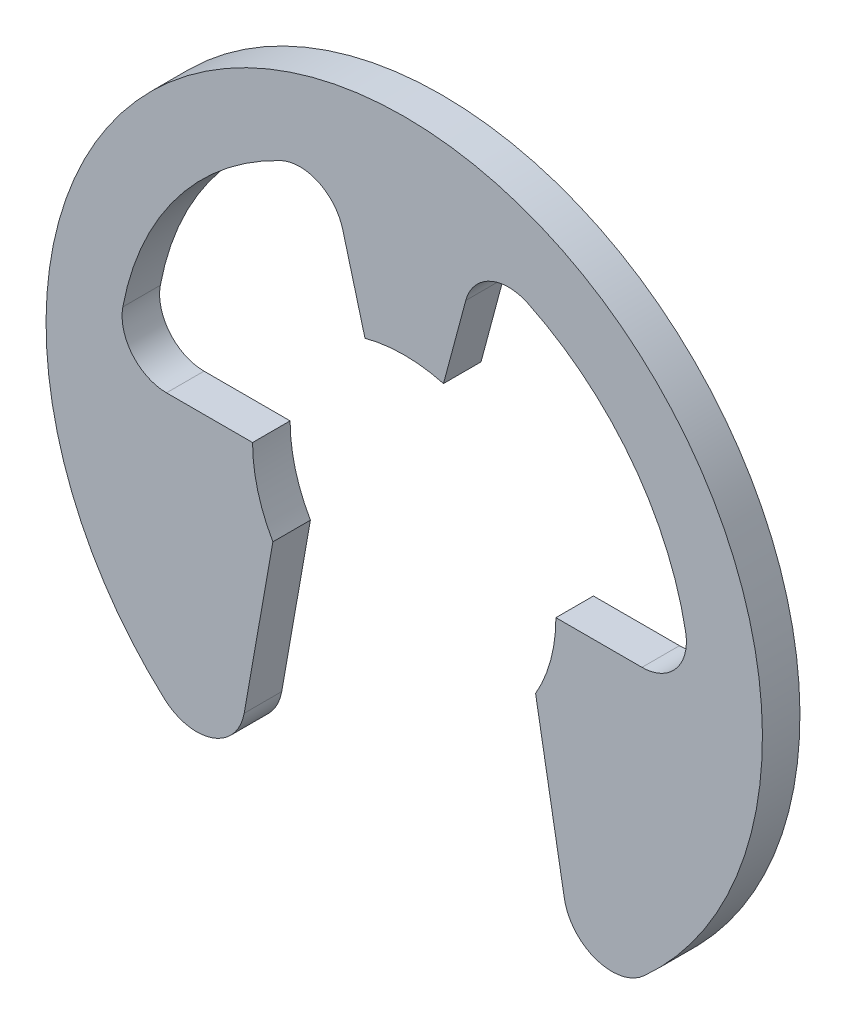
ISO-10303-21;
HEADER;
FILE_DESCRIPTION(('STEP AP214'),'2;1');
FILE_NAME('part.step','',(''),(''),'','','');
FILE_SCHEMA(('AUTOMOTIVE_DESIGN { 1 0 10303 214 1 1 1 1 }'));
ENDSEC;
DATA;
#1=APPLICATION_CONTEXT('core data for automotive mechanical design processes');
#2=APPLICATION_PROTOCOL_DEFINITION('international standard','automotive_design',2000,#1);
#3=PRODUCT_CONTEXT('',#1,'mechanical');
#4=PRODUCT('Part','Part','',(#3));
#5=PRODUCT_RELATED_PRODUCT_CATEGORY('part','',(#4));
#6=PRODUCT_DEFINITION_FORMATION('','',#4);
#7=PRODUCT_DEFINITION_CONTEXT('part definition',#1,'design');
#8=PRODUCT_DEFINITION('design','',#6,#7);
#9=PRODUCT_DEFINITION_SHAPE('','',#8);
#10=(LENGTH_UNIT() NAMED_UNIT(*) SI_UNIT(.MILLI.,.METRE.));
#11=(NAMED_UNIT(*) PLANE_ANGLE_UNIT() SI_UNIT($,.RADIAN.));
#12=(NAMED_UNIT(*) SI_UNIT($,.STERADIAN.) SOLID_ANGLE_UNIT());
#13=UNCERTAINTY_MEASURE_WITH_UNIT(LENGTH_MEASURE(1.E-05),#10,'distance_accuracy_value','');
#14=(GEOMETRIC_REPRESENTATION_CONTEXT(3) GLOBAL_UNCERTAINTY_ASSIGNED_CONTEXT((#13)) GLOBAL_UNIT_ASSIGNED_CONTEXT((#10,
#11,#12)) REPRESENTATION_CONTEXT('',''));
#15=CARTESIAN_POINT('',(0.,0.,0.));
#16=DIRECTION('',(0.,0.,1.));
#17=DIRECTION('',(1.,0.,0.));
#18=AXIS2_PLACEMENT_3D('',#15,#16,#17);
#19=CARTESIAN_POINT('',(3.80114798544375,0.710202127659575,-0.6));
#20=DIRECTION('',(0.,0.,1.));
#21=DIRECTION('',(1.,0.,0.));
#22=AXIS2_PLACEMENT_3D('',#19,#20,#21);
#23=CYLINDRICAL_SURFACE('',#22,0.710202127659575);
#24=CARTESIAN_POINT('',(3.80114798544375,0.710202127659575,0.));
#25=DIRECTION('',(0.,0.,-1.));
#26=DIRECTION('',(1.,0.,0.));
#27=AXIS2_PLACEMENT_3D('',#24,#25,#26);
#28=CIRCLE('',#27,0.710202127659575);
#29=CARTESIAN_POINT('',(4.49926936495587,0.840638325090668,0.));
#30=VERTEX_POINT('',#29);
#31=CARTESIAN_POINT('',(3.80114798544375,0.,0.));
#32=VERTEX_POINT('',#31);
#33=EDGE_CURVE('E150',#30,#32,#28,.T.);
#34=ORIENTED_EDGE('',*,*,#33,.F.);
#35=DIRECTION('',(0.,0.,1.));
#36=VECTOR('',#35,1.);
#37=CARTESIAN_POINT('',(4.49926936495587,0.840638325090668,-0.6));
#38=LINE('',#37,#36);
#39=CARTESIAN_POINT('',(4.49926936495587,0.840638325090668,-0.6));
#40=VERTEX_POINT('',#39);
#41=EDGE_CURVE('E11',#40,#30,#38,.T.);
#42=ORIENTED_EDGE('',*,*,#41,.F.);
#43=CARTESIAN_POINT('',(3.80114798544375,0.710202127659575,-0.6));
#44=DIRECTION('',(0.,0.,-1.));
#45=DIRECTION('',(1.,0.,0.));
#46=AXIS2_PLACEMENT_3D('',#43,#44,#45);
#47=CIRCLE('',#46,0.710202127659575);
#48=CARTESIAN_POINT('',(3.80114798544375,0.,-0.6));
#49=VERTEX_POINT('',#48);
#50=EDGE_CURVE('E152',#40,#49,#47,.T.);
#51=ORIENTED_EDGE('',*,*,#50,.T.);
#52=DIRECTION('',(0.,0.,1.));
#53=VECTOR('',#52,1.);
#54=CARTESIAN_POINT('',(3.80114798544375,0.,-0.6));
#55=LINE('',#54,#53);
#56=EDGE_CURVE('E29',#49,#32,#55,.T.);
#57=ORIENTED_EDGE('',*,*,#56,.T.);
#58=EDGE_LOOP('',(#34,#42,#51,#57));
#59=FACE_BOUND('',#58,.T.);
#60=ADVANCED_FACE('F26',(#59),#23,.F.);
#61=CARTESIAN_POINT('',(0.,0.,-0.6));
#62=DIRECTION('',(0.,0.,1.));
#63=DIRECTION('',(1.,0.,0.));
#64=AXIS2_PLACEMENT_3D('',#61,#62,#63);
#65=CYLINDRICAL_SURFACE('',#64,4.57712765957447);
#66=CARTESIAN_POINT('',(0.,0.,0.));
#67=DIRECTION('',(0.,0.,-1.));
#68=DIRECTION('',(1.,0.,0.));
#69=AXIS2_PLACEMENT_3D('',#66,#67,#68);
#70=CIRCLE('',#69,4.57712765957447);
#71=CARTESIAN_POINT('',(1.97649086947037,4.12838727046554,0.));
#72=VERTEX_POINT('',#71);
#73=EDGE_CURVE('E168',#72,#30,#70,.T.);
#74=ORIENTED_EDGE('',*,*,#73,.F.);
#75=DIRECTION('',(0.,0.,1.));
#76=VECTOR('',#75,1.);
#77=CARTESIAN_POINT('',(1.97649086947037,4.12838727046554,-0.6));
#78=LINE('',#77,#76);
#79=CARTESIAN_POINT('',(1.97649086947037,4.12838727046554,-0.6));
#80=VERTEX_POINT('',#79);
#81=EDGE_CURVE('E34',#80,#72,#78,.T.);
#82=ORIENTED_EDGE('',*,*,#81,.F.);
#83=CARTESIAN_POINT('',(0.,0.,-0.6));
#84=DIRECTION('',(0.,0.,-1.));
#85=DIRECTION('',(1.,0.,0.));
#86=AXIS2_PLACEMENT_3D('',#83,#84,#85);
#87=CIRCLE('',#86,4.57712765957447);
#88=EDGE_CURVE('E157',#80,#40,#87,.T.);
#89=ORIENTED_EDGE('',*,*,#88,.T.);
#90=ORIENTED_EDGE('',*,*,#41,.T.);
#91=EDGE_LOOP('',(#74,#82,#89,#90));
#92=FACE_BOUND('',#91,.T.);
#93=ADVANCED_FACE('F347',(#92),#65,.F.);
#94=CARTESIAN_POINT('',(1.66981206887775,3.48781317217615,-0.6));
#95=DIRECTION('',(0.,0.,1.));
#96=DIRECTION('',(1.,0.,0.));
#97=AXIS2_PLACEMENT_3D('',#94,#95,#96);
#98=CYLINDRICAL_SURFACE('',#97,0.710202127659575);
#99=CARTESIAN_POINT('',(1.66981206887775,3.48781317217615,0.));
#100=DIRECTION('',(0.,0.,-1.));
#101=DIRECTION('',(1.,0.,0.));
#102=AXIS2_PLACEMENT_3D('',#99,#100,#101);
#103=CIRCLE('',#102,0.710202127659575);
#104=CARTESIAN_POINT('',(0.983809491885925,3.67162700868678,0.));
#105=VERTEX_POINT('',#104);
#106=EDGE_CURVE('E211',#105,#72,#103,.T.);
#107=ORIENTED_EDGE('',*,*,#106,.F.);
#108=DIRECTION('',(0.,0.,1.));
#109=VECTOR('',#108,1.);
#110=CARTESIAN_POINT('',(0.983809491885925,3.67162700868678,-0.6));
#111=LINE('',#110,#109);
#112=CARTESIAN_POINT('',(0.983809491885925,3.67162700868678,-0.6));
#113=VERTEX_POINT('',#112);
#114=EDGE_CURVE('E263',#113,#105,#111,.T.);
#115=ORIENTED_EDGE('',*,*,#114,.F.);
#116=CARTESIAN_POINT('',(1.66981206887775,3.48781317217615,-0.6));
#117=DIRECTION('',(0.,0.,-1.));
#118=DIRECTION('',(1.,0.,0.));
#119=AXIS2_PLACEMENT_3D('',#116,#117,#118);
#120=CIRCLE('',#119,0.710202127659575);
#121=EDGE_CURVE('E259',#113,#80,#120,.T.);
#122=ORIENTED_EDGE('',*,*,#121,.T.);
#123=ORIENTED_EDGE('',*,*,#81,.T.);
#124=EDGE_LOOP('',(#107,#115,#122,#123));
#125=FACE_BOUND('',#124,.T.);
#126=ADVANCED_FACE('F352',(#125),#98,.F.);
#127=CARTESIAN_POINT('',(0.627636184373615,2.34237012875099,-0.6));
#128=DIRECTION('',(0.965925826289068,-0.258819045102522,0.));
#129=DIRECTION('',(0.258819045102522,0.965925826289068,0.));
#130=AXIS2_PLACEMENT_3D('',#127,#128,#129);
#131=PLANE('',#130);
#132=DIRECTION('',(0.258819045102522,0.965925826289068,0.));
#133=VECTOR('',#132,1.);
#134=CARTESIAN_POINT('',(0.627636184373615,2.34237012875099,0.));
#135=LINE('',#134,#133);
#136=CARTESIAN_POINT('',(0.627636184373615,2.34237012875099,0.));
#137=VERTEX_POINT('',#136);
#138=EDGE_CURVE('E208',#137,#105,#135,.T.);
#139=ORIENTED_EDGE('',*,*,#138,.F.);
#140=DIRECTION('',(0.,0.,1.));
#141=VECTOR('',#140,1.);
#142=CARTESIAN_POINT('',(0.627636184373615,2.34237012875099,-0.6));
#143=LINE('',#142,#141);
#144=CARTESIAN_POINT('',(0.627636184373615,2.34237012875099,-0.6));
#145=VERTEX_POINT('',#144);
#146=EDGE_CURVE('E265',#145,#137,#143,.T.);
#147=ORIENTED_EDGE('',*,*,#146,.F.);
#148=DIRECTION('',(0.258819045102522,0.965925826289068,0.));
#149=VECTOR('',#148,1.);
#150=CARTESIAN_POINT('',(0.627636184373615,2.34237012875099,-0.6));
#151=LINE('',#150,#149);
#152=EDGE_CURVE('E256',#145,#113,#151,.T.);
#153=ORIENTED_EDGE('',*,*,#152,.T.);
#154=ORIENTED_EDGE('',*,*,#114,.T.);
#155=EDGE_LOOP('',(#139,#147,#153,#154));
#156=FACE_BOUND('',#155,.T.);
#157=ADVANCED_FACE('F344',(#156),#131,.T.);
#158=CARTESIAN_POINT('',(0.,0.,-0.6));
#159=DIRECTION('',(0.,0.,1.));
#160=DIRECTION('',(1.,0.,0.));
#161=AXIS2_PLACEMENT_3D('',#158,#159,#160);
#162=CYLINDRICAL_SURFACE('',#161,2.425);
#163=CARTESIAN_POINT('',(0.,0.,0.));
#164=DIRECTION('',(0.,0.,-1.));
#165=DIRECTION('',(-1.,0.,0.));
#166=AXIS2_PLACEMENT_3D('',#163,#164,#165);
#167=CIRCLE('',#166,2.425);
#168=CARTESIAN_POINT('',(-0.627636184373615,2.34237012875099,0.));
#169=VERTEX_POINT('',#168);
#170=EDGE_CURVE('E205',#169,#137,#167,.T.);
#171=ORIENTED_EDGE('',*,*,#170,.F.);
#172=DIRECTION('',(0.,0.,1.));
#173=VECTOR('',#172,1.);
#174=CARTESIAN_POINT('',(-0.627636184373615,2.34237012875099,-0.6));
#175=LINE('',#174,#173);
#176=CARTESIAN_POINT('',(-0.627636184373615,2.34237012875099,-0.6));
#177=VERTEX_POINT('',#176);
#178=EDGE_CURVE('E267',#177,#169,#175,.T.);
#179=ORIENTED_EDGE('',*,*,#178,.F.);
#180=CARTESIAN_POINT('',(0.,0.,-0.6));
#181=DIRECTION('',(0.,0.,-1.));
#182=DIRECTION('',(-1.,0.,0.));
#183=AXIS2_PLACEMENT_3D('',#180,#181,#182);
#184=CIRCLE('',#183,2.425);
#185=EDGE_CURVE('E253',#177,#145,#184,.T.);
#186=ORIENTED_EDGE('',*,*,#185,.T.);
#187=ORIENTED_EDGE('',*,*,#146,.T.);
#188=EDGE_LOOP('',(#171,#179,#186,#187));
#189=FACE_BOUND('',#188,.T.);
#190=ADVANCED_FACE('F340',(#189),#162,.F.);
#191=CARTESIAN_POINT('',(-0.627636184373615,2.34237012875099,-0.6));
#192=DIRECTION('',(-0.965925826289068,-0.258819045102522,0.));
#193=DIRECTION('',(0.258819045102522,-0.965925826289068,0.));
#194=AXIS2_PLACEMENT_3D('',#191,#192,#193);
#195=PLANE('',#194);
#196=DIRECTION('',(0.258819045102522,-0.965925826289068,0.));
#197=VECTOR('',#196,1.);
#198=CARTESIAN_POINT('',(-0.627636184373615,2.34237012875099,0.));
#199=LINE('',#198,#197);
#200=CARTESIAN_POINT('',(-0.983809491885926,3.67162700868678,0.));
#201=VERTEX_POINT('',#200);
#202=EDGE_CURVE('E202',#201,#169,#199,.T.);
#203=ORIENTED_EDGE('',*,*,#202,.F.);
#204=DIRECTION('',(0.,0.,1.));
#205=VECTOR('',#204,1.);
#206=CARTESIAN_POINT('',(-0.983809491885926,3.67162700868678,-0.6));
#207=LINE('',#206,#205);
#208=CARTESIAN_POINT('',(-0.983809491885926,3.67162700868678,-0.6));
#209=VERTEX_POINT('',#208);
#210=EDGE_CURVE('E269',#209,#201,#207,.T.);
#211=ORIENTED_EDGE('',*,*,#210,.F.);
#212=DIRECTION('',(0.258819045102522,-0.965925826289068,0.));
#213=VECTOR('',#212,1.);
#214=CARTESIAN_POINT('',(-0.627636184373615,2.34237012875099,-0.6));
#215=LINE('',#214,#213);
#216=EDGE_CURVE('E250',#209,#177,#215,.T.);
#217=ORIENTED_EDGE('',*,*,#216,.T.);
#218=ORIENTED_EDGE('',*,*,#178,.T.);
#219=EDGE_LOOP('',(#203,#211,#217,#218));
#220=FACE_BOUND('',#219,.T.);
#221=ADVANCED_FACE('F336',(#220),#195,.T.);
#222=CARTESIAN_POINT('',(-1.66981206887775,3.48781317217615,-0.6));
#223=DIRECTION('',(0.,0.,1.));
#224=DIRECTION('',(1.,0.,0.));
#225=AXIS2_PLACEMENT_3D('',#222,#223,#224);
#226=CYLINDRICAL_SURFACE('',#225,0.710202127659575);
#227=CARTESIAN_POINT('',(-1.66981206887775,3.48781317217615,0.));
#228=DIRECTION('',(0.,0.,-1.));
#229=DIRECTION('',(1.,0.,0.));
#230=AXIS2_PLACEMENT_3D('',#227,#228,#229);
#231=CIRCLE('',#230,0.710202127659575);
#232=CARTESIAN_POINT('',(-1.97649086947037,4.12838727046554,0.));
#233=VERTEX_POINT('',#232);
#234=EDGE_CURVE('E199',#233,#201,#231,.T.);
#235=ORIENTED_EDGE('',*,*,#234,.F.);
#236=DIRECTION('',(0.,0.,1.));
#237=VECTOR('',#236,1.);
#238=CARTESIAN_POINT('',(-1.97649086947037,4.12838727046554,-0.6));
#239=LINE('',#238,#237);
#240=CARTESIAN_POINT('',(-1.97649086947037,4.12838727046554,-0.6));
#241=VERTEX_POINT('',#240);
#242=EDGE_CURVE('E271',#241,#233,#239,.T.);
#243=ORIENTED_EDGE('',*,*,#242,.F.);
#244=CARTESIAN_POINT('',(-1.66981206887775,3.48781317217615,-0.6));
#245=DIRECTION('',(0.,0.,-1.));
#246=DIRECTION('',(1.,0.,0.));
#247=AXIS2_PLACEMENT_3D('',#244,#245,#246);
#248=CIRCLE('',#247,0.710202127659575);
#249=EDGE_CURVE('E247',#241,#209,#248,.T.);
#250=ORIENTED_EDGE('',*,*,#249,.T.);
#251=ORIENTED_EDGE('',*,*,#210,.T.);
#252=EDGE_LOOP('',(#235,#243,#250,#251));
#253=FACE_BOUND('',#252,.T.);
#254=ADVANCED_FACE('F332',(#253),#226,.F.);
#255=CARTESIAN_POINT('',(0.,0.,-0.6));
#256=DIRECTION('',(0.,0.,1.));
#257=DIRECTION('',(1.,0.,0.));
#258=AXIS2_PLACEMENT_3D('',#255,#256,#257);
#259=CYLINDRICAL_SURFACE('',#258,4.57712765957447);
#260=CARTESIAN_POINT('',(0.,0.,0.));
#261=DIRECTION('',(0.,0.,-1.));
#262=DIRECTION('',(1.,0.,0.));
#263=AXIS2_PLACEMENT_3D('',#260,#261,#262);
#264=CIRCLE('',#263,4.57712765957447);
#265=CARTESIAN_POINT('',(-4.49926936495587,0.840638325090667,0.));
#266=VERTEX_POINT('',#265);
#267=EDGE_CURVE('E196',#266,#233,#264,.T.);
#268=ORIENTED_EDGE('',*,*,#267,.F.);
#269=DIRECTION('',(0.,0.,1.));
#270=VECTOR('',#269,1.);
#271=CARTESIAN_POINT('',(-4.49926936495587,0.840638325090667,-0.6));
#272=LINE('',#271,#270);
#273=CARTESIAN_POINT('',(-4.49926936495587,0.840638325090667,-0.6));
#274=VERTEX_POINT('',#273);
#275=EDGE_CURVE('E273',#274,#266,#272,.T.);
#276=ORIENTED_EDGE('',*,*,#275,.F.);
#277=CARTESIAN_POINT('',(0.,0.,-0.6));
#278=DIRECTION('',(0.,0.,-1.));
#279=DIRECTION('',(1.,0.,0.));
#280=AXIS2_PLACEMENT_3D('',#277,#278,#279);
#281=CIRCLE('',#280,4.57712765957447);
#282=EDGE_CURVE('E244',#274,#241,#281,.T.);
#283=ORIENTED_EDGE('',*,*,#282,.T.);
#284=ORIENTED_EDGE('',*,*,#242,.T.);
#285=EDGE_LOOP('',(#268,#276,#283,#284));
#286=FACE_BOUND('',#285,.T.);
#287=ADVANCED_FACE('F328',(#286),#259,.F.);
#288=CARTESIAN_POINT('',(-3.80114798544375,0.710202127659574,-0.6));
#289=DIRECTION('',(0.,0.,1.));
#290=DIRECTION('',(1.,0.,0.));
#291=AXIS2_PLACEMENT_3D('',#288,#289,#290);
#292=CYLINDRICAL_SURFACE('',#291,0.710202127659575);
#293=CARTESIAN_POINT('',(-3.80114798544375,0.710202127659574,0.));
#294=DIRECTION('',(0.,0.,-1.));
#295=DIRECTION('',(1.,0.,0.));
#296=AXIS2_PLACEMENT_3D('',#293,#294,#295);
#297=CIRCLE('',#296,0.710202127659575);
#298=CARTESIAN_POINT('',(-3.80114798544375,0.,0.));
#299=VERTEX_POINT('',#298);
#300=EDGE_CURVE('E193',#299,#266,#297,.T.);
#301=ORIENTED_EDGE('',*,*,#300,.F.);
#302=DIRECTION('',(0.,0.,1.));
#303=VECTOR('',#302,1.);
#304=CARTESIAN_POINT('',(-3.80114798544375,0.,-0.6));
#305=LINE('',#304,#303);
#306=CARTESIAN_POINT('',(-3.80114798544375,0.,-0.6));
#307=VERTEX_POINT('',#306);
#308=EDGE_CURVE('E275',#307,#299,#305,.T.);
#309=ORIENTED_EDGE('',*,*,#308,.F.);
#310=CARTESIAN_POINT('',(-3.80114798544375,0.710202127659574,-0.6));
#311=DIRECTION('',(0.,0.,-1.));
#312=DIRECTION('',(1.,0.,0.));
#313=AXIS2_PLACEMENT_3D('',#310,#311,#312);
#314=CIRCLE('',#313,0.710202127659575);
#315=EDGE_CURVE('E241',#307,#274,#314,.T.);
#316=ORIENTED_EDGE('',*,*,#315,.T.);
#317=ORIENTED_EDGE('',*,*,#275,.T.);
#318=EDGE_LOOP('',(#301,#309,#316,#317));
#319=FACE_BOUND('',#318,.T.);
#320=ADVANCED_FACE('F324',(#319),#292,.F.);
#321=CARTESIAN_POINT('',(-2.425,0.,-0.6));
#322=DIRECTION('',(0.,1.,0.));
#323=DIRECTION('',(-1.,0.,0.));
#324=AXIS2_PLACEMENT_3D('',#321,#322,#323);
#325=PLANE('',#324);
#326=DIRECTION('',(-1.,0.,0.));
#327=VECTOR('',#326,1.);
#328=CARTESIAN_POINT('',(-2.425,0.,0.));
#329=LINE('',#328,#327);
#330=CARTESIAN_POINT('',(-2.425,0.,0.));
#331=VERTEX_POINT('',#330);
#332=EDGE_CURVE('E190',#331,#299,#329,.T.);
#333=ORIENTED_EDGE('',*,*,#332,.F.);
#334=DIRECTION('',(0.,0.,1.));
#335=VECTOR('',#334,1.);
#336=CARTESIAN_POINT('',(-2.425,0.,-0.6));
#337=LINE('',#336,#335);
#338=CARTESIAN_POINT('',(-2.425,0.,-0.6));
#339=VERTEX_POINT('',#338);
#340=EDGE_CURVE('E277',#339,#331,#337,.T.);
#341=ORIENTED_EDGE('',*,*,#340,.F.);
#342=DIRECTION('',(-1.,0.,0.));
#343=VECTOR('',#342,1.);
#344=CARTESIAN_POINT('',(-2.425,0.,-0.6));
#345=LINE('',#344,#343);
#346=EDGE_CURVE('E238',#339,#307,#345,.T.);
#347=ORIENTED_EDGE('',*,*,#346,.T.);
#348=ORIENTED_EDGE('',*,*,#308,.T.);
#349=EDGE_LOOP('',(#333,#341,#347,#348));
#350=FACE_BOUND('',#349,.T.);
#351=ADVANCED_FACE('F320',(#350),#325,.T.);
#352=CARTESIAN_POINT('',(0.,0.,-0.6));
#353=DIRECTION('',(0.,0.,1.));
#354=DIRECTION('',(1.,0.,0.));
#355=AXIS2_PLACEMENT_3D('',#352,#353,#354);
#356=CYLINDRICAL_SURFACE('',#355,2.425);
#357=CARTESIAN_POINT('',(0.,0.,0.));
#358=DIRECTION('',(0.,0.,-1.));
#359=DIRECTION('',(1.,0.,0.));
#360=AXIS2_PLACEMENT_3D('',#357,#358,#359);
#361=CIRCLE('',#360,2.425);
#362=CARTESIAN_POINT('',(-2.10011160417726,-1.2125,0.));
#363=VERTEX_POINT('',#362);
#364=EDGE_CURVE('E187',#363,#331,#361,.T.);
#365=ORIENTED_EDGE('',*,*,#364,.F.);
#366=DIRECTION('',(0.,0.,1.));
#367=VECTOR('',#366,1.);
#368=CARTESIAN_POINT('',(-2.10011160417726,-1.2125,-0.6));
#369=LINE('',#368,#367);
#370=CARTESIAN_POINT('',(-2.10011160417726,-1.2125,-0.6));
#371=VERTEX_POINT('',#370);
#372=EDGE_CURVE('E279',#371,#363,#369,.T.);
#373=ORIENTED_EDGE('',*,*,#372,.F.);
#374=CARTESIAN_POINT('',(0.,0.,-0.6));
#375=DIRECTION('',(0.,0.,-1.));
#376=DIRECTION('',(1.,0.,0.));
#377=AXIS2_PLACEMENT_3D('',#374,#375,#376);
#378=CIRCLE('',#377,2.425);
#379=EDGE_CURVE('E235',#371,#339,#378,.T.);
#380=ORIENTED_EDGE('',*,*,#379,.T.);
#381=ORIENTED_EDGE('',*,*,#340,.T.);
#382=EDGE_LOOP('',(#365,#373,#380,#381));
#383=FACE_BOUND('',#382,.T.);
#384=ADVANCED_FACE('F316',(#383),#356,.F.);
#385=CARTESIAN_POINT('',(-2.10011160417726,-1.2125,-0.6));
#386=DIRECTION('',(0.984807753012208,-0.17364817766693,0.));
#387=DIRECTION('',(0.17364817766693,0.984807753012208,0.));
#388=AXIS2_PLACEMENT_3D('',#385,#386,#387);
#389=PLANE('',#388);
#390=DIRECTION('',(0.17364817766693,0.984807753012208,0.));
#391=VECTOR('',#390,1.);
#392=CARTESIAN_POINT('',(-2.10011160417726,-1.2125,0.));
#393=LINE('',#392,#391);
#394=CARTESIAN_POINT('',(-2.55919096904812,-3.81606845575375,0.));
#395=VERTEX_POINT('',#394);
#396=EDGE_CURVE('E184',#395,#363,#393,.T.);
#397=ORIENTED_EDGE('',*,*,#396,.F.);
#398=DIRECTION('',(0.,0.,1.));
#399=VECTOR('',#398,1.);
#400=CARTESIAN_POINT('',(-2.55919096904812,-3.81606845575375,-0.6));
#401=LINE('',#400,#399);
#402=CARTESIAN_POINT('',(-2.55919096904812,-3.81606845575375,-0.6));
#403=VERTEX_POINT('',#402);
#404=EDGE_CURVE('E281',#403,#395,#401,.T.);
#405=ORIENTED_EDGE('',*,*,#404,.F.);
#406=DIRECTION('',(0.17364817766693,0.984807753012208,0.));
#407=VECTOR('',#406,1.);
#408=CARTESIAN_POINT('',(-2.10011160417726,-1.2125,-0.6));
#409=LINE('',#408,#407);
#410=EDGE_CURVE('E232',#403,#371,#409,.T.);
#411=ORIENTED_EDGE('',*,*,#410,.T.);
#412=ORIENTED_EDGE('',*,*,#372,.T.);
#413=EDGE_LOOP('',(#397,#405,#411,#412));
#414=FACE_BOUND('',#413,.T.);
#415=ADVANCED_FACE('F312',(#414),#389,.T.);
#416=CARTESIAN_POINT('',(-3.31798534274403,-3.68227253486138,-0.6));
#417=DIRECTION('',(0.,0.,1.));
#418=DIRECTION('',(1.,0.,0.));
#419=AXIS2_PLACEMENT_3D('',#416,#417,#418);
#420=CYLINDRICAL_SURFACE('',#419,0.7705);
#421=CARTESIAN_POINT('',(-3.31798534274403,-3.68227253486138,0.));
#422=DIRECTION('',(0.,0.,1.));
#423=DIRECTION('',(1.,0.,0.));
#424=AXIS2_PLACEMENT_3D('',#421,#422,#423);
#425=CIRCLE('',#424,0.7705);
#426=CARTESIAN_POINT('',(-3.83376096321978,-4.25467602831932,0.));
#427=VERTEX_POINT('',#426);
#428=EDGE_CURVE('E181',#427,#395,#425,.T.);
#429=ORIENTED_EDGE('',*,*,#428,.F.);
#430=DIRECTION('',(0.,0.,1.));
#431=VECTOR('',#430,1.);
#432=CARTESIAN_POINT('',(-3.83376096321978,-4.25467602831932,-0.6));
#433=LINE('',#432,#431);
#434=CARTESIAN_POINT('',(-3.83376096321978,-4.25467602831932,-0.6));
#435=VERTEX_POINT('',#434);
#436=EDGE_CURVE('E283',#435,#427,#433,.T.);
#437=ORIENTED_EDGE('',*,*,#436,.F.);
#438=CARTESIAN_POINT('',(-3.31798534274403,-3.68227253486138,-0.6));
#439=DIRECTION('',(0.,0.,1.));
#440=DIRECTION('',(1.,0.,0.));
#441=AXIS2_PLACEMENT_3D('',#438,#439,#440);
#442=CIRCLE('',#441,0.7705);
#443=EDGE_CURVE('E229',#435,#403,#442,.T.);
#444=ORIENTED_EDGE('',*,*,#443,.T.);
#445=ORIENTED_EDGE('',*,*,#404,.T.);
#446=EDGE_LOOP('',(#429,#437,#444,#445));
#447=FACE_BOUND('',#446,.T.);
#448=ADVANCED_FACE('F308',(#447),#420,.T.);
#449=CARTESIAN_POINT('',(0.,0.,-0.6));
#450=DIRECTION('',(0.,0.,1.));
#451=DIRECTION('',(1.,0.,0.));
#452=AXIS2_PLACEMENT_3D('',#449,#450,#451);
#453=CYLINDRICAL_SURFACE('',#452,5.72712765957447);
#454=CARTESIAN_POINT('',(0.,0.,0.));
#455=DIRECTION('',(0.,0.,1.));
#456=DIRECTION('',(1.,0.,0.));
#457=AXIS2_PLACEMENT_3D('',#454,#455,#456);
#458=CIRCLE('',#457,5.72712765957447);
#459=CARTESIAN_POINT('',(3.83376096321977,-4.25467602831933,0.));
#460=VERTEX_POINT('',#459);
#461=EDGE_CURVE('E178',#460,#427,#458,.T.);
#462=ORIENTED_EDGE('',*,*,#461,.F.);
#463=DIRECTION('',(0.,0.,1.));
#464=VECTOR('',#463,1.);
#465=CARTESIAN_POINT('',(3.83376096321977,-4.25467602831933,-0.6));
#466=LINE('',#465,#464);
#467=CARTESIAN_POINT('',(3.83376096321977,-4.25467602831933,-0.6));
#468=VERTEX_POINT('',#467);
#469=EDGE_CURVE('E285',#468,#460,#466,.T.);
#470=ORIENTED_EDGE('',*,*,#469,.F.);
#471=CARTESIAN_POINT('',(0.,0.,-0.6));
#472=DIRECTION('',(0.,0.,1.));
#473=DIRECTION('',(1.,0.,0.));
#474=AXIS2_PLACEMENT_3D('',#471,#472,#473);
#475=CIRCLE('',#474,5.72712765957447);
#476=EDGE_CURVE('E226',#468,#435,#475,.T.);
#477=ORIENTED_EDGE('',*,*,#476,.T.);
#478=ORIENTED_EDGE('',*,*,#436,.T.);
#479=EDGE_LOOP('',(#462,#470,#477,#478));
#480=FACE_BOUND('',#479,.T.);
#481=ADVANCED_FACE('F304',(#480),#453,.T.);
#482=CARTESIAN_POINT('',(3.31798534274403,-3.68227253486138,-0.6));
#483=DIRECTION('',(0.,0.,1.));
#484=DIRECTION('',(1.,0.,0.));
#485=AXIS2_PLACEMENT_3D('',#482,#483,#484);
#486=CYLINDRICAL_SURFACE('',#485,0.7705);
#487=CARTESIAN_POINT('',(3.31798534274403,-3.68227253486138,0.));
#488=DIRECTION('',(0.,0.,1.));
#489=DIRECTION('',(1.,0.,0.));
#490=AXIS2_PLACEMENT_3D('',#487,#488,#489);
#491=CIRCLE('',#490,0.7705);
#492=CARTESIAN_POINT('',(2.55919096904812,-3.81606845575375,0.));
#493=VERTEX_POINT('',#492);
#494=EDGE_CURVE('E175',#493,#460,#491,.T.);
#495=ORIENTED_EDGE('',*,*,#494,.F.);
#496=DIRECTION('',(0.,0.,1.));
#497=VECTOR('',#496,1.);
#498=CARTESIAN_POINT('',(2.55919096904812,-3.81606845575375,-0.6));
#499=LINE('',#498,#497);
#500=CARTESIAN_POINT('',(2.55919096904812,-3.81606845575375,-0.6));
#501=VERTEX_POINT('',#500);
#502=EDGE_CURVE('E287',#501,#493,#499,.T.);
#503=ORIENTED_EDGE('',*,*,#502,.F.);
#504=CARTESIAN_POINT('',(3.31798534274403,-3.68227253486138,-0.6));
#505=DIRECTION('',(0.,0.,1.));
#506=DIRECTION('',(1.,0.,0.));
#507=AXIS2_PLACEMENT_3D('',#504,#505,#506);
#508=CIRCLE('',#507,0.7705);
#509=EDGE_CURVE('E223',#501,#468,#508,.T.);
#510=ORIENTED_EDGE('',*,*,#509,.T.);
#511=ORIENTED_EDGE('',*,*,#469,.T.);
#512=EDGE_LOOP('',(#495,#503,#510,#511));
#513=FACE_BOUND('',#512,.T.);
#514=ADVANCED_FACE('F300',(#513),#486,.T.);
#515=CARTESIAN_POINT('',(2.10011160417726,-1.2125,-0.6));
#516=DIRECTION('',(-0.984807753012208,-0.17364817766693,0.));
#517=DIRECTION('',(0.17364817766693,-0.984807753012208,0.));
#518=AXIS2_PLACEMENT_3D('',#515,#516,#517);
#519=PLANE('',#518);
#520=DIRECTION('',(0.17364817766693,-0.984807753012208,0.));
#521=VECTOR('',#520,1.);
#522=CARTESIAN_POINT('',(2.10011160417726,-1.2125,0.));
#523=LINE('',#522,#521);
#524=CARTESIAN_POINT('',(2.10011160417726,-1.2125,0.));
#525=VERTEX_POINT('',#524);
#526=EDGE_CURVE('E172',#525,#493,#523,.T.);
#527=ORIENTED_EDGE('',*,*,#526,.F.);
#528=DIRECTION('',(0.,0.,1.));
#529=VECTOR('',#528,1.);
#530=CARTESIAN_POINT('',(2.10011160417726,-1.2125,-0.6));
#531=LINE('',#530,#529);
#532=CARTESIAN_POINT('',(2.10011160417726,-1.2125,-0.6));
#533=VERTEX_POINT('',#532);
#534=EDGE_CURVE('E289',#533,#525,#531,.T.);
#535=ORIENTED_EDGE('',*,*,#534,.F.);
#536=DIRECTION('',(0.17364817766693,-0.984807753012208,0.));
#537=VECTOR('',#536,1.);
#538=CARTESIAN_POINT('',(2.10011160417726,-1.2125,-0.6));
#539=LINE('',#538,#537);
#540=EDGE_CURVE('E220',#533,#501,#539,.T.);
#541=ORIENTED_EDGE('',*,*,#540,.T.);
#542=ORIENTED_EDGE('',*,*,#502,.T.);
#543=EDGE_LOOP('',(#527,#535,#541,#542));
#544=FACE_BOUND('',#543,.T.);
#545=ADVANCED_FACE('F296',(#544),#519,.T.);
#546=CARTESIAN_POINT('',(0.,0.,-0.6));
#547=DIRECTION('',(0.,0.,1.));
#548=DIRECTION('',(1.,0.,0.));
#549=AXIS2_PLACEMENT_3D('',#546,#547,#548);
#550=CYLINDRICAL_SURFACE('',#549,2.425);
#551=CARTESIAN_POINT('',(0.,0.,0.));
#552=DIRECTION('',(0.,0.,-1.));
#553=DIRECTION('',(1.,0.,0.));
#554=AXIS2_PLACEMENT_3D('',#551,#552,#553);
#555=CIRCLE('',#554,2.425);
#556=CARTESIAN_POINT('',(2.425,0.,0.));
#557=VERTEX_POINT('',#556);
#558=EDGE_CURVE('E164',#557,#525,#555,.T.);
#559=ORIENTED_EDGE('',*,*,#558,.F.);
#560=DIRECTION('',(0.,0.,1.));
#561=VECTOR('',#560,1.);
#562=CARTESIAN_POINT('',(2.425,0.,-0.6));
#563=LINE('',#562,#561);
#564=CARTESIAN_POINT('',(2.425,0.,-0.6));
#565=VERTEX_POINT('',#564);
#566=EDGE_CURVE('E156',#565,#557,#563,.T.);
#567=ORIENTED_EDGE('',*,*,#566,.F.);
#568=CARTESIAN_POINT('',(0.,0.,-0.6));
#569=DIRECTION('',(0.,0.,-1.));
#570=DIRECTION('',(1.,0.,0.));
#571=AXIS2_PLACEMENT_3D('',#568,#569,#570);
#572=CIRCLE('',#571,2.425);
#573=EDGE_CURVE('E217',#565,#533,#572,.T.);
#574=ORIENTED_EDGE('',*,*,#573,.T.);
#575=ORIENTED_EDGE('',*,*,#534,.T.);
#576=EDGE_LOOP('',(#559,#567,#574,#575));
#577=FACE_BOUND('',#576,.T.);
#578=ADVANCED_FACE('F292',(#577),#550,.F.);
#579=CARTESIAN_POINT('',(2.425,0.,-0.6));
#580=DIRECTION('',(0.,1.,0.));
#581=DIRECTION('',(0.,0.,1.));
#582=AXIS2_PLACEMENT_3D('',#579,#580,#581);
#583=PLANE('',#582);
#584=DIRECTION('',(-1.,0.,0.));
#585=VECTOR('',#584,1.);
#586=CARTESIAN_POINT('',(2.425,0.,0.));
#587=LINE('',#586,#585);
#588=EDGE_CURVE('E159',#32,#557,#587,.T.);
#589=ORIENTED_EDGE('',*,*,#588,.F.);
#590=ORIENTED_EDGE('',*,*,#56,.F.);
#591=DIRECTION('',(-1.,0.,0.));
#592=VECTOR('',#591,1.);
#593=CARTESIAN_POINT('',(2.425,0.,-0.6));
#594=LINE('',#593,#592);
#595=EDGE_CURVE('E215',#49,#565,#594,.T.);
#596=ORIENTED_EDGE('',*,*,#595,.T.);
#597=ORIENTED_EDGE('',*,*,#566,.T.);
#598=EDGE_LOOP('',(#589,#590,#596,#597));
#599=FACE_BOUND('',#598,.T.);
#600=ADVANCED_FACE('F160',(#599),#583,.T.);
#601=CARTESIAN_POINT('',(3.80114798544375,0.710202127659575,-0.6));
#602=DIRECTION('',(0.,0.,1.));
#603=DIRECTION('',(1.,0.,0.));
#604=AXIS2_PLACEMENT_3D('',#601,#602,#603);
#605=PLANE('',#604);
#606=ORIENTED_EDGE('',*,*,#50,.F.);
#607=ORIENTED_EDGE('',*,*,#88,.F.);
#608=ORIENTED_EDGE('',*,*,#121,.F.);
#609=ORIENTED_EDGE('',*,*,#152,.F.);
#610=ORIENTED_EDGE('',*,*,#185,.F.);
#611=ORIENTED_EDGE('',*,*,#216,.F.);
#612=ORIENTED_EDGE('',*,*,#249,.F.);
#613=ORIENTED_EDGE('',*,*,#282,.F.);
#614=ORIENTED_EDGE('',*,*,#315,.F.);
#615=ORIENTED_EDGE('',*,*,#346,.F.);
#616=ORIENTED_EDGE('',*,*,#379,.F.);
#617=ORIENTED_EDGE('',*,*,#410,.F.);
#618=ORIENTED_EDGE('',*,*,#443,.F.);
#619=ORIENTED_EDGE('',*,*,#476,.F.);
#620=ORIENTED_EDGE('',*,*,#509,.F.);
#621=ORIENTED_EDGE('',*,*,#540,.F.);
#622=ORIENTED_EDGE('',*,*,#573,.F.);
#623=ORIENTED_EDGE('',*,*,#595,.F.);
#624=EDGE_LOOP('',(#606,#607,#608,#609,#610,#611,#612,#613,#614,#615,#616,#617,#618,#619,#620,
#621,#622,#623));
#625=FACE_BOUND('',#624,.T.);
#626=ADVANCED_FACE('F351',(#625),#605,.F.);
#627=CARTESIAN_POINT('',(3.80114798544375,0.710202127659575,0.));
#628=DIRECTION('',(0.,0.,1.));
#629=DIRECTION('',(1.,0.,0.));
#630=AXIS2_PLACEMENT_3D('',#627,#628,#629);
#631=PLANE('',#630);
#632=ORIENTED_EDGE('',*,*,#33,.T.);
#633=ORIENTED_EDGE('',*,*,#588,.T.);
#634=ORIENTED_EDGE('',*,*,#558,.T.);
#635=ORIENTED_EDGE('',*,*,#526,.T.);
#636=ORIENTED_EDGE('',*,*,#494,.T.);
#637=ORIENTED_EDGE('',*,*,#461,.T.);
#638=ORIENTED_EDGE('',*,*,#428,.T.);
#639=ORIENTED_EDGE('',*,*,#396,.T.);
#640=ORIENTED_EDGE('',*,*,#364,.T.);
#641=ORIENTED_EDGE('',*,*,#332,.T.);
#642=ORIENTED_EDGE('',*,*,#300,.T.);
#643=ORIENTED_EDGE('',*,*,#267,.T.);
#644=ORIENTED_EDGE('',*,*,#234,.T.);
#645=ORIENTED_EDGE('',*,*,#202,.T.);
#646=ORIENTED_EDGE('',*,*,#170,.T.);
#647=ORIENTED_EDGE('',*,*,#138,.T.);
#648=ORIENTED_EDGE('',*,*,#106,.T.);
#649=ORIENTED_EDGE('',*,*,#73,.T.);
#650=EDGE_LOOP('',(#632,#633,#634,#635,#636,#637,#638,#639,#640,#641,#642,#643,#644,#645,#646,
#647,#648,#649));
#651=FACE_BOUND('',#650,.T.);
#652=ADVANCED_FACE('F166',(#651),#631,.T.);
#653=CLOSED_SHELL('',(#60,#93,#126,#157,#190,#221,#254,#287,#320,#351,#384,#415,#448,#481,#514,
#545,#578,#600,#626,#652));
#654=MANIFOLD_SOLID_BREP('B2',#653);
#655=ADVANCED_BREP_SHAPE_REPRESENTATION('',(#18,#654),#14);
#656=SHAPE_DEFINITION_REPRESENTATION(#9,#655);
ENDSEC;
END-ISO-10303-21;
